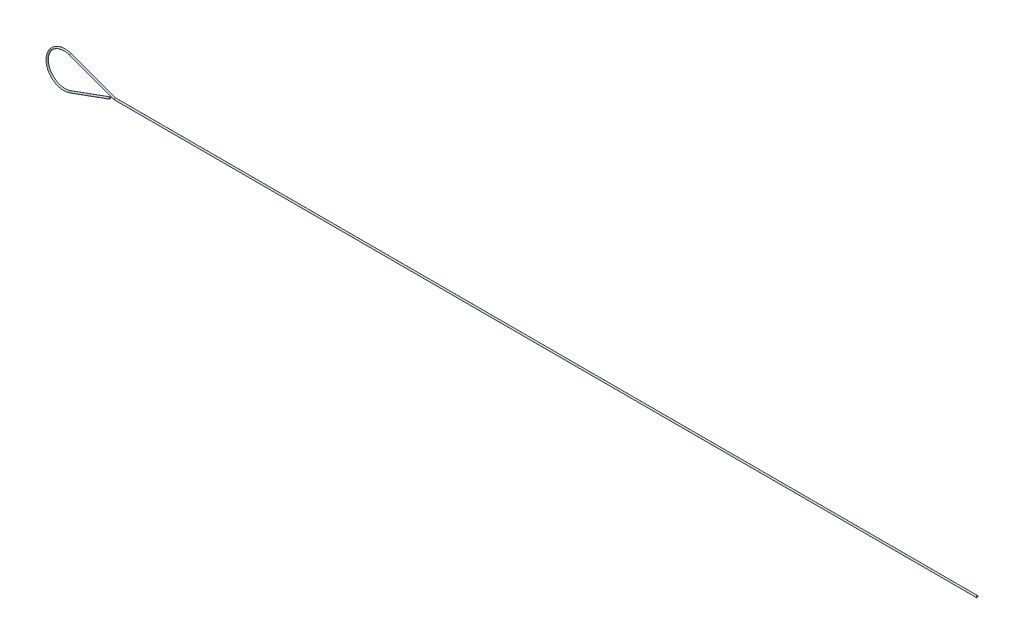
from build123d import *

# Parameters (mm, degrees)
ESQUISSE3_R = 0.5


with BuildPart() as part:
    # Balayage2: sweep along a path in Esquisse1
    with BuildLine(Plane.XY) as balayage2_path:
        Line((529.238044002, 0), (29.238044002, 0))
        Line((29.238044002, 0), (3.420201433, 9.396926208))
        ThreePointArc((3.420201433, 9.396926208), (-10, 0), (3.420201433, -9.396926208))
        Line((3.420201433, -9.396926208), (26.341026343, -1.054428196))
    # Esquisse3 → Balayage2 (sweep)
    with BuildSketch(Plane(origin=(529.238044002, 0, 0), x_dir=(0, 0, -1), z_dir=(1, 0, 0))):
        Circle(ESQUISSE3_R)
    sweep(path=balayage2_path.line, transition=Transition.RIGHT)


solid = part.part
